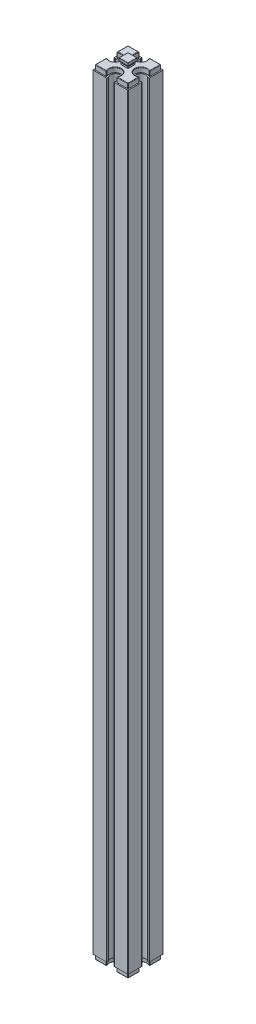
from build123d import *

# Parameters (mm, degrees)
EXTRUDE_1_DEPTH        = 163
EXTRUDE_2_DEPTH        = 2
EXTRUDE_3_DEPTH        = 2
FILLET_3_R             = 0.2
CUT_EXTRUDE_1_DEPTH    = 3
FILLET_4_R             = 0.2
FILLET_5_R             = 0.1
FILLET_3_OF_MIRROR_1_R = 0.2
FILLET_4_OF_MIRROR_1_R = 0.2
FILLET_5_OF_MIRROR_1_R = 0.1


with BuildPart() as part:
    # Sketch 1 → Extrude 1 (new body)
    with BuildSketch(Plane(origin=(0, 0, 0), x_dir=(1, 0, 0), z_dir=(0, 1, 0))):
        with BuildLine():
            Line((-7.5, 7.5), (-1.5, 7.5))
            Line((-1.5, 7.5), (-1.5, 6.822875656))
            ThreePointArc((-1.5, 6.822875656), (0, 3.5), (1.5, 6.822875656))
            Line((1.5, 6.822875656), (1.5, 7.5))
            Line((1.5, 7.5), (7.5, 7.5))
            Line((7.5, 7.5), (7.5, 1.5))
            Line((7.5, 1.5), (6.822875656, 1.5))
            ThreePointArc((6.822875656, 1.5), (3.5, 0), (6.822875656, -1.5))
            Line((6.822875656, -1.5), (7.5, -1.5))
            Line((7.5, -1.5), (7.5, -7.5))
            Line((7.5, -7.5), (1.5, -7.5))
            Line((1.5, -7.5), (1.5, -6.822875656))
            ThreePointArc((1.5, -6.822875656), (0, -3.5), (-1.5, -6.822875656))
            Line((-1.5, -6.822875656), (-1.5, -7.5))
            Line((-1.5, -7.5), (-7.5, -7.5))
            Line((-7.5, -7.5), (-7.5, -1.5))
            Line((-7.5, -1.5), (-6.822875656, -1.5))
            ThreePointArc((-6.822875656, -1.5), (-3.5, 0), (-6.822875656, 1.5))
            Line((-6.822875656, 1.5), (-7.5, 1.5))
            Line((-7.5, 1.5), (-7.5, 7.5))
        make_face()
    extrude_1 = extrude(amount=EXTRUDE_1_DEPTH)

    # Sketch 2 → Extrude 2 (add)
    with BuildSketch(Plane(origin=(0, 163, 0), x_dir=(1, 0, 0), z_dir=(0, 1, 0))):
        with BuildLine():
            Line((-7, 7), (-7, 2))
            ThreePointArc((-7, 2), (-3, 0), (-7, -2))
            Line((-7, -2), (-7, -7))
            Line((-7, -7), (-2, -7))
            ThreePointArc((-2, -7), (0, -3), (2, -7))
            Line((2, -7), (7, -7))
            Line((7, -7), (7, -2))
            ThreePointArc((7, -2), (3, 0), (7, 2))
            Line((7, 2), (7, 7))
            Line((7, 7), (2, 7))
            ThreePointArc((2, 7), (0, 3), (-2, 7))
            Line((-2, 7), (-7, 7))
        make_face()
    extrude_2 = extrude(amount=EXTRUDE_2_DEPTH)

    # Sketch 3 → Extrude 3 (add, symmetric)
    with BuildSketch(Plane(origin=(0, 0, 0), x_dir=(0, 0, -1), z_dir=(1, 0, 0))):
        with BuildLine():
            Line((-1.5, 165), (1.5, 165))
            Line((1.5, 165), (1.5, 165.677124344))
            ThreePointArc((1.5, 165.677124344), (1.780042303, 166.088161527), (1.95, 166.555590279))
            Line((1.95, 166.555590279), (1.95, 167.5))
            Line((1.95, 167.5), (-1.95, 167.5))
            Line((-1.95, 167.5), (-1.95, 166.555590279))
            ThreePointArc((-1.95, 166.555590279), (-1.780042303, 166.088161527), (-1.5, 165.677124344))
            Line((-1.5, 165.677124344), (-1.5, 165))
        make_face()
    extrude_3 = extrude(amount=EXTRUDE_3_DEPTH, both=True)

    # Fillet 3
    fillet_3_edges = [part.edges().sort_by_distance(p)[0] for p in [
        (-7.5, 81.5, -7.5),
        (-1.5, 81.5, -7.5),
        (1.5, 81.5, -7.5),
        (7.5, 81.5, -7.5),
        (7.5, 81.5, -1.5),
        (7.5, 81.5, 1.5),
        (7.5, 81.5, 7.5),
        (1.5, 81.5, 7.5),
        (-1.5, 81.5, 7.5),
        (-7.5, 81.5, 7.5),
        (-7.5, 81.5, 1.5),
        (-6.822875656, 81.5, -1.5),
        (-7.5, 81.5, -1.5),
    ]]
    fillet(fillet_3_edges, radius=FILLET_3_R)

    # Sketch 4 → Cut-Extrude 1 (cut, symmetric)
    with BuildSketch(Plane.XY):
        with BuildLine():
            Line((1.95, 167.5), (2, 167.5))
            Line((2, 167.5), (2, 165))
            Line((2, 165), (1.5, 165))
            Line((1.5, 165), (1.5, 165.677124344))
            ThreePointArc((1.5, 165.677124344), (1.780042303, 166.088161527), (1.95, 166.555590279))
            Line((1.95, 166.555590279), (1.95, 167.5))
        make_face()
        with BuildLine():
            Line((-1.95, 167.5), (-1.95, 166.555590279))
            ThreePointArc((-1.95, 166.555590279), (-1.780042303, 166.088161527), (-1.5, 165.677124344))
            Line((-1.5, 165.677124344), (-1.5, 165))
            Line((-1.5, 165), (-2, 165))
            Line((-2, 165), (-2, 167.5))
            Line((-2, 167.5), (-1.95, 167.5))
        make_face()
    cut_extrude_1 = extrude(amount=CUT_EXTRUDE_1_DEPTH, both=True, mode=Mode.SUBTRACT)

    # Fillet 4
    fillet_4_edges = [part.edges().sort_by_distance(p)[0] for p in [
        (-2, 164, -7),
        (-7, 164, -7),
        (-7, 164, -2),
        (-7, 164, 2),
        (-7, 164, 7),
        (-2, 164, 7),
        (2, 164, 7),
        (7, 164, 7),
        (7, 164, 2),
        (7, 164, -2),
        (7, 164, -7),
        (2, 164, -7),
        (-4.5, 165, -7),
        (-7, 165, -4.5),
        (-3, 165, 0),
        (-7, 165, 4.5),
        (-4.5, 165, 7),
        (0, 165, 3),
        (4.5, 165, 7),
        (7, 165, 4.5),
        (3, 165, 0),
        (7, 165, -4.5),
        (4.5, 165, -7),
        (0, 165, -3),
    ]]
    fillet(fillet_4_edges, radius=FILLET_4_R)

    # Fillet 5
    fillet_5_edges = [part.edges().sort_by_distance(p)[0] for p in [
        (1.95, 167.5, 0),
        (0, 167.5, -1.95),
        (0, 167.5, 1.95),
        (-1.95, 167.5, 0),
    ]]
    fillet(fillet_5_edges, radius=FILLET_5_R)

    # Mirror 1: Extrude 1, Extrude 2, Extrude 3, Cut-Extrude 1 across Top Plane
    add(extrude_1.mirror(Plane(origin=(0, 0, 0), x_dir=(1, 0, 0), z_dir=(0, 1, 0))))
    add(extrude_2.mirror(Plane(origin=(0, 0, 0), x_dir=(1, 0, 0), z_dir=(0, 1, 0))))
    add(extrude_3.mirror(Plane(origin=(0, 0, 0), x_dir=(1, 0, 0), z_dir=(0, 1, 0))))
    add(cut_extrude_1.mirror(Plane(origin=(0, 0, 0), x_dir=(1, 0, 0), z_dir=(0, 1, 0))), mode=Mode.SUBTRACT)

    # Fillet 3 of Mirror 1
    fillet_3_of_mirror_1_edges = [part.edges().sort_by_distance(p)[0] for p in [
        (-7.5, -81.5, -7.5),
        (-1.5, -81.5, -7.5),
        (1.5, -81.5, -7.5),
        (7.5, -81.5, -7.5),
        (7.5, -81.5, -1.5),
        (7.5, -81.5, 1.5),
        (7.5, -81.5, 7.5),
        (1.5, -81.5, 7.5),
        (-1.5, -81.5, 7.5),
        (-7.5, -81.5, 7.5),
        (-7.5, -81.5, 1.5),
        (-6.822875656, -81.5, -1.5),
        (-7.5, -81.5, -1.5),
    ]]
    fillet(fillet_3_of_mirror_1_edges, radius=FILLET_3_OF_MIRROR_1_R)

    # Fillet 4 of Mirror 1
    fillet_4_of_mirror_1_edges = [part.edges().sort_by_distance(p)[0] for p in [
        (-2, -164, -7),
        (-7, -164, -7),
        (-7, -164, -2),
        (-7, -164, 2),
        (-7, -164, 7),
        (-2, -164, 7),
        (2, -164, 7),
        (7, -164, 7),
        (7, -164, 2),
        (7, -164, -2),
        (7, -164, -7),
        (2, -164, -7),
        (-4.5, -165, -7),
        (-7, -165, -4.5),
        (-3, -165, 0),
        (-7, -165, 4.5),
        (-4.5, -165, 7),
        (0, -165, 3),
        (4.5, -165, 7),
        (7, -165, 4.5),
        (3, -165, 0),
        (7, -165, -4.5),
        (4.5, -165, -7),
        (0, -165, -3),
    ]]
    fillet(fillet_4_of_mirror_1_edges, radius=FILLET_4_OF_MIRROR_1_R)

    # Fillet 5 of Mirror 1
    fillet_5_of_mirror_1_edges = [part.edges().sort_by_distance(p)[0] for p in [
        (1.95, -167.5, 0),
        (0, -167.5, -1.95),
        (0, -167.5, 1.95),
        (-1.95, -167.5, 0),
    ]]
    fillet(fillet_5_of_mirror_1_edges, radius=FILLET_5_OF_MIRROR_1_R)


solid = part.part
